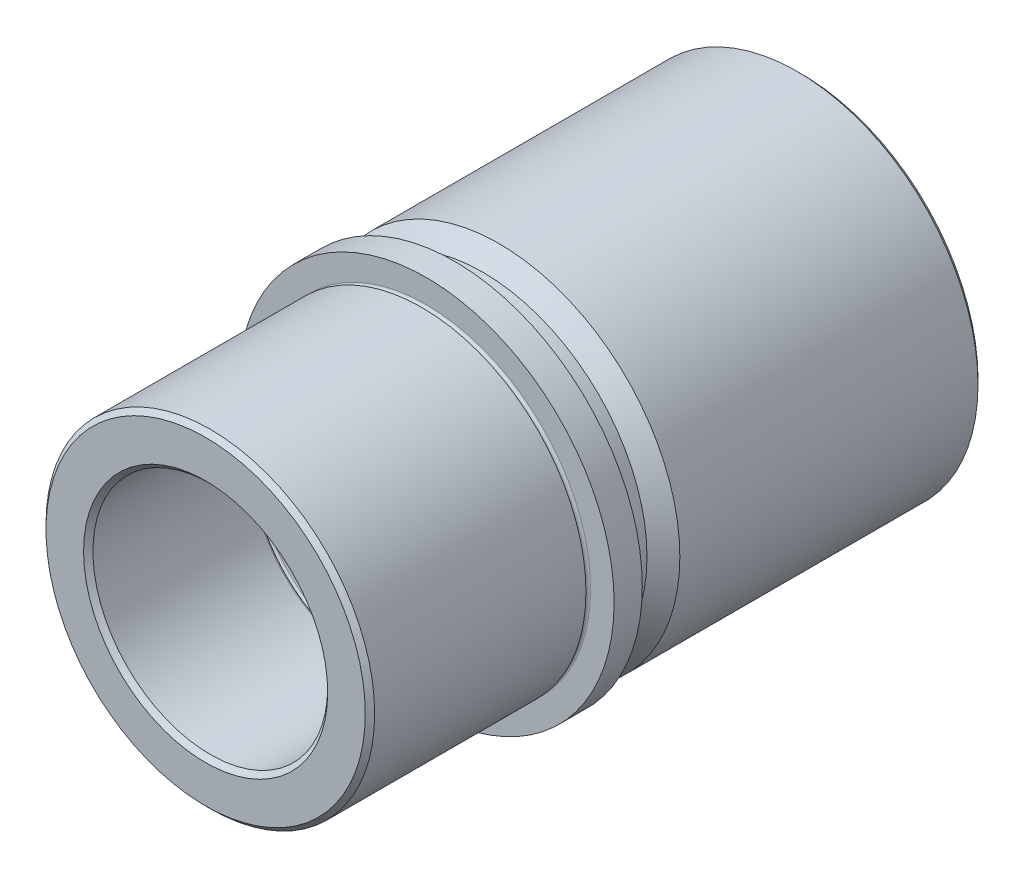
ISO-10303-21;
HEADER;
FILE_DESCRIPTION(('STEP AP214'),'2;1');
FILE_NAME('part.step','',(''),(''),'','','');
FILE_SCHEMA(('AUTOMOTIVE_DESIGN { 1 0 10303 214 1 1 1 1 }'));
ENDSEC;
DATA;
#1=APPLICATION_CONTEXT('core data for automotive mechanical design processes');
#2=APPLICATION_PROTOCOL_DEFINITION('international standard','automotive_design',2000,#1);
#3=PRODUCT_CONTEXT('',#1,'mechanical');
#4=PRODUCT('Part','Part','',(#3));
#5=PRODUCT_RELATED_PRODUCT_CATEGORY('part','',(#4));
#6=PRODUCT_DEFINITION_FORMATION('','',#4);
#7=PRODUCT_DEFINITION_CONTEXT('part definition',#1,'design');
#8=PRODUCT_DEFINITION('design','',#6,#7);
#9=PRODUCT_DEFINITION_SHAPE('','',#8);
#10=(LENGTH_UNIT() NAMED_UNIT(*) SI_UNIT(.MILLI.,.METRE.));
#11=(NAMED_UNIT(*) PLANE_ANGLE_UNIT() SI_UNIT($,.RADIAN.));
#12=(NAMED_UNIT(*) SI_UNIT($,.STERADIAN.) SOLID_ANGLE_UNIT());
#13=UNCERTAINTY_MEASURE_WITH_UNIT(LENGTH_MEASURE(1.E-05),#10,'distance_accuracy_value','');
#14=(GEOMETRIC_REPRESENTATION_CONTEXT(3) GLOBAL_UNCERTAINTY_ASSIGNED_CONTEXT((#13)) GLOBAL_UNIT_ASSIGNED_CONTEXT((#10,
#11,#12)) REPRESENTATION_CONTEXT('',''));
#15=CARTESIAN_POINT('',(0.,0.,0.));
#16=DIRECTION('',(0.,0.,1.));
#17=DIRECTION('',(1.,0.,0.));
#18=AXIS2_PLACEMENT_3D('',#15,#16,#17);
#19=CARTESIAN_POINT('',(0.,0.,-83.5));
#20=DIRECTION('',(0.,0.,1.));
#21=DIRECTION('',(1.,0.,0.));
#22=AXIS2_PLACEMENT_3D('',#19,#20,#21);
#23=TOROIDAL_SURFACE('',#22,25.5,0.5);
#24=CARTESIAN_POINT('',(0.,0.,-83.5));
#25=DIRECTION('',(0.,0.,1.));
#26=DIRECTION('',(1.,0.,0.));
#27=AXIS2_PLACEMENT_3D('',#24,#25,#26);
#28=CIRCLE('',#27,25.);
#29=CARTESIAN_POINT('',(25.,0.,-83.5));
#30=VERTEX_POINT('',#29);
#31=EDGE_CURVE('E81',#30,#30,#28,.T.);
#32=ORIENTED_EDGE('',*,*,#31,.T.);
#33=EDGE_LOOP('',(#32));
#34=FACE_BOUND('',#33,.T.);
#35=CARTESIAN_POINT('',(0.,0.,-84.));
#36=DIRECTION('',(0.,0.,1.));
#37=DIRECTION('',(1.,0.,0.));
#38=AXIS2_PLACEMENT_3D('',#35,#36,#37);
#39=CIRCLE('',#38,25.5);
#40=CARTESIAN_POINT('',(25.5,0.,-84.));
#41=VERTEX_POINT('',#40);
#42=EDGE_CURVE('E45',#41,#41,#39,.T.);
#43=ORIENTED_EDGE('',*,*,#42,.F.);
#44=EDGE_LOOP('',(#43));
#45=FACE_BOUND('',#44,.T.);
#46=ADVANCED_FACE('F13',(#34,#45),#23,.T.);
#47=CARTESIAN_POINT('',(0.,0.,-84.5));
#48=DIRECTION('',(0.,0.,1.));
#49=DIRECTION('',(1.,0.,0.));
#50=AXIS2_PLACEMENT_3D('',#47,#48,#49);
#51=TOROIDAL_SURFACE('',#50,25.5,0.5);
#52=CARTESIAN_POINT('',(0.,0.,-84.5));
#53=DIRECTION('',(0.,0.,1.));
#54=DIRECTION('',(1.,0.,0.));
#55=AXIS2_PLACEMENT_3D('',#52,#53,#54);
#56=CIRCLE('',#55,25.);
#57=CARTESIAN_POINT('',(25.,0.,-84.5));
#58=VERTEX_POINT('',#57);
#59=EDGE_CURVE('E48',#58,#58,#56,.T.);
#60=ORIENTED_EDGE('',*,*,#59,.F.);
#61=EDGE_LOOP('',(#60));
#62=FACE_BOUND('',#61,.T.);
#63=ORIENTED_EDGE('',*,*,#42,.T.);
#64=EDGE_LOOP('',(#63));
#65=FACE_BOUND('',#64,.T.);
#66=ADVANCED_FACE('F113',(#62,#65),#51,.T.);
#67=CARTESIAN_POINT('',(0.,0.,0.));
#68=DIRECTION('',(0.,0.,1.));
#69=DIRECTION('',(1.,0.,0.));
#70=AXIS2_PLACEMENT_3D('',#67,#68,#69);
#71=CYLINDRICAL_SURFACE('',#70,25.);
#72=CARTESIAN_POINT('',(0.,0.,-126.));
#73=DIRECTION('',(0.,0.,1.));
#74=DIRECTION('',(1.,0.,0.));
#75=AXIS2_PLACEMENT_3D('',#72,#73,#74);
#76=CIRCLE('',#75,25.);
#77=CARTESIAN_POINT('',(25.,0.,-126.));
#78=VERTEX_POINT('',#77);
#79=EDGE_CURVE('E36',#78,#78,#76,.F.);
#80=ORIENTED_EDGE('',*,*,#79,.T.);
#81=EDGE_LOOP('',(#80));
#82=FACE_BOUND('',#81,.T.);
#83=ORIENTED_EDGE('',*,*,#59,.T.);
#84=EDGE_LOOP('',(#83));
#85=FACE_BOUND('',#84,.T.);
#86=ADVANCED_FACE('F118',(#82,#85),#71,.F.);
#87=CARTESIAN_POINT('',(0.,0.,-127.));
#88=DIRECTION('',(0.,0.,1.));
#89=DIRECTION('',(1.,0.,0.));
#90=AXIS2_PLACEMENT_3D('',#87,#88,#89);
#91=PLANE('',#90);
#92=CARTESIAN_POINT('',(0.,0.,-127.));
#93=DIRECTION('',(0.,0.,1.));
#94=DIRECTION('',(1.,0.,0.));
#95=AXIS2_PLACEMENT_3D('',#92,#93,#94);
#96=CIRCLE('',#95,26.);
#97=CARTESIAN_POINT('',(26.,0.,-127.));
#98=VERTEX_POINT('',#97);
#99=EDGE_CURVE('E39',#98,#98,#96,.T.);
#100=ORIENTED_EDGE('',*,*,#99,.T.);
#101=EDGE_LOOP('',(#100));
#102=FACE_BOUND('',#101,.T.);
#103=CARTESIAN_POINT('',(0.,0.,-127.));
#104=DIRECTION('',(0.,0.,1.));
#105=DIRECTION('',(1.,0.,0.));
#106=AXIS2_PLACEMENT_3D('',#103,#104,#105);
#107=CIRCLE('',#106,37.5);
#108=CARTESIAN_POINT('',(37.5,0.,-127.));
#109=VERTEX_POINT('',#108);
#110=EDGE_CURVE('E42',#109,#109,#107,.F.);
#111=ORIENTED_EDGE('',*,*,#110,.T.);
#112=EDGE_LOOP('',(#111));
#113=FACE_BOUND('',#112,.T.);
#114=ADVANCED_FACE('F185',(#102,#113),#91,.F.);
#115=CARTESIAN_POINT('',(0.,0.,0.));
#116=DIRECTION('',(0.,0.,1.));
#117=DIRECTION('',(1.,0.,0.));
#118=AXIS2_PLACEMENT_3D('',#115,#116,#117);
#119=CYLINDRICAL_SURFACE('',#118,38.5);
#120=CARTESIAN_POINT('',(0.,0.,-126.));
#121=DIRECTION('',(0.,0.,1.));
#122=DIRECTION('',(1.,0.,0.));
#123=AXIS2_PLACEMENT_3D('',#120,#121,#122);
#124=CIRCLE('',#123,38.5);
#125=CARTESIAN_POINT('',(38.5,0.,-126.));
#126=VERTEX_POINT('',#125);
#127=EDGE_CURVE('E33',#126,#126,#124,.T.);
#128=ORIENTED_EDGE('',*,*,#127,.T.);
#129=EDGE_LOOP('',(#128));
#130=FACE_BOUND('',#129,.T.);
#131=CARTESIAN_POINT('',(0.,0.,-62.5));
#132=DIRECTION('',(0.,0.,1.));
#133=DIRECTION('',(1.,0.,0.));
#134=AXIS2_PLACEMENT_3D('',#131,#132,#133);
#135=CIRCLE('',#134,38.5);
#136=CARTESIAN_POINT('',(38.5,0.,-62.5));
#137=VERTEX_POINT('',#136);
#138=EDGE_CURVE('E51',#137,#137,#135,.T.);
#139=ORIENTED_EDGE('',*,*,#138,.F.);
#140=EDGE_LOOP('',(#139));
#141=FACE_BOUND('',#140,.T.);
#142=ADVANCED_FACE('F181',(#130,#141),#119,.T.);
#143=CARTESIAN_POINT('',(0.,0.,-59.));
#144=DIRECTION('',(0.,0.,-1.));
#145=DIRECTION('',(-1.,0.,0.));
#146=AXIS2_PLACEMENT_3D('',#143,#144,#145);
#147=CONICAL_SURFACE('',#146,35.,0.785398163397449);
#148=ORIENTED_EDGE('',*,*,#138,.T.);
#149=EDGE_LOOP('',(#148));
#150=FACE_BOUND('',#149,.T.);
#151=CARTESIAN_POINT('',(0.,0.,-59.));
#152=DIRECTION('',(0.,0.,1.));
#153=DIRECTION('',(1.,0.,0.));
#154=AXIS2_PLACEMENT_3D('',#151,#152,#153);
#155=CIRCLE('',#154,35.);
#156=CARTESIAN_POINT('',(35.,0.,-59.));
#157=VERTEX_POINT('',#156);
#158=EDGE_CURVE('E54',#157,#157,#155,.T.);
#159=ORIENTED_EDGE('',*,*,#158,.F.);
#160=EDGE_LOOP('',(#159));
#161=FACE_BOUND('',#160,.T.);
#162=ADVANCED_FACE('F177',(#150,#161),#147,.T.);
#163=CARTESIAN_POINT('',(0.,0.,0.));
#164=DIRECTION('',(0.,0.,1.));
#165=DIRECTION('',(1.,0.,0.));
#166=AXIS2_PLACEMENT_3D('',#163,#164,#165);
#167=CYLINDRICAL_SURFACE('',#166,35.);
#168=ORIENTED_EDGE('',*,*,#158,.T.);
#169=EDGE_LOOP('',(#168));
#170=FACE_BOUND('',#169,.T.);
#171=CARTESIAN_POINT('',(0.,0.,-53.));
#172=DIRECTION('',(0.,0.,1.));
#173=DIRECTION('',(1.,0.,0.));
#174=AXIS2_PLACEMENT_3D('',#171,#172,#173);
#175=CIRCLE('',#174,35.);
#176=CARTESIAN_POINT('',(35.,0.,-53.));
#177=VERTEX_POINT('',#176);
#178=EDGE_CURVE('E57',#177,#177,#175,.T.);
#179=ORIENTED_EDGE('',*,*,#178,.F.);
#180=EDGE_LOOP('',(#179));
#181=FACE_BOUND('',#180,.T.);
#182=ADVANCED_FACE('F173',(#170,#181),#167,.T.);
#183=CARTESIAN_POINT('',(0.,0.,-53.));
#184=DIRECTION('',(0.,0.,-1.));
#185=DIRECTION('',(-1.,0.,0.));
#186=AXIS2_PLACEMENT_3D('',#183,#184,#185);
#187=PLANE('',#186);
#188=ORIENTED_EDGE('',*,*,#178,.T.);
#189=EDGE_LOOP('',(#188));
#190=FACE_BOUND('',#189,.T.);
#191=CARTESIAN_POINT('',(0.,0.,-53.));
#192=DIRECTION('',(0.,0.,1.));
#193=DIRECTION('',(1.,0.,0.));
#194=AXIS2_PLACEMENT_3D('',#191,#192,#193);
#195=CIRCLE('',#194,40.);
#196=CARTESIAN_POINT('',(40.,0.,-53.));
#197=VERTEX_POINT('',#196);
#198=EDGE_CURVE('E60',#197,#197,#195,.T.);
#199=ORIENTED_EDGE('',*,*,#198,.F.);
#200=EDGE_LOOP('',(#199));
#201=FACE_BOUND('',#200,.T.);
#202=ADVANCED_FACE('F169',(#190,#201),#187,.T.);
#203=CARTESIAN_POINT('',(0.,0.,0.));
#204=DIRECTION('',(0.,0.,1.));
#205=DIRECTION('',(1.,0.,0.));
#206=AXIS2_PLACEMENT_3D('',#203,#204,#205);
#207=CYLINDRICAL_SURFACE('',#206,40.);
#208=ORIENTED_EDGE('',*,*,#198,.T.);
#209=EDGE_LOOP('',(#208));
#210=FACE_BOUND('',#209,.T.);
#211=CARTESIAN_POINT('',(0.,0.,-47.));
#212=DIRECTION('',(0.,0.,1.));
#213=DIRECTION('',(1.,0.,0.));
#214=AXIS2_PLACEMENT_3D('',#211,#212,#213);
#215=CIRCLE('',#214,40.);
#216=CARTESIAN_POINT('',(40.,0.,-47.));
#217=VERTEX_POINT('',#216);
#218=EDGE_CURVE('E63',#217,#217,#215,.T.);
#219=ORIENTED_EDGE('',*,*,#218,.F.);
#220=EDGE_LOOP('',(#219));
#221=FACE_BOUND('',#220,.T.);
#222=ADVANCED_FACE('F165',(#210,#221),#207,.T.);
#223=CARTESIAN_POINT('',(0.,0.,-47.));
#224=DIRECTION('',(0.,0.,1.));
#225=DIRECTION('',(1.,0.,0.));
#226=AXIS2_PLACEMENT_3D('',#223,#224,#225);
#227=PLANE('',#226);
#228=ORIENTED_EDGE('',*,*,#218,.T.);
#229=EDGE_LOOP('',(#228));
#230=FACE_BOUND('',#229,.T.);
#231=CARTESIAN_POINT('',(0.,0.,-47.));
#232=DIRECTION('',(0.,0.,1.));
#233=DIRECTION('',(1.,0.,0.));
#234=AXIS2_PLACEMENT_3D('',#231,#232,#233);
#235=CIRCLE('',#234,35.);
#236=CARTESIAN_POINT('',(35.,0.,-47.));
#237=VERTEX_POINT('',#236);
#238=EDGE_CURVE('E66',#237,#237,#235,.T.);
#239=ORIENTED_EDGE('',*,*,#238,.F.);
#240=EDGE_LOOP('',(#239));
#241=FACE_BOUND('',#240,.T.);
#242=ADVANCED_FACE('F161',(#230,#241),#227,.T.);
#243=CARTESIAN_POINT('',(0.,0.,-46.5));
#244=DIRECTION('',(0.,0.,1.));
#245=DIRECTION('',(1.,0.,0.));
#246=AXIS2_PLACEMENT_3D('',#243,#244,#245);
#247=TOROIDAL_SURFACE('',#246,35.,0.5);
#248=ORIENTED_EDGE('',*,*,#238,.T.);
#249=EDGE_LOOP('',(#248));
#250=FACE_BOUND('',#249,.T.);
#251=CARTESIAN_POINT('',(0.,0.,-46.));
#252=DIRECTION('',(0.,0.,1.));
#253=DIRECTION('',(1.,0.,0.));
#254=AXIS2_PLACEMENT_3D('',#251,#252,#253);
#255=CIRCLE('',#254,35.);
#256=CARTESIAN_POINT('',(35.,0.,-46.));
#257=VERTEX_POINT('',#256);
#258=EDGE_CURVE('E69',#257,#257,#255,.T.);
#259=ORIENTED_EDGE('',*,*,#258,.F.);
#260=EDGE_LOOP('',(#259));
#261=FACE_BOUND('',#260,.T.);
#262=ADVANCED_FACE('F156',(#250,#261),#247,.F.);
#263=CARTESIAN_POINT('',(0.,0.,0.));
#264=DIRECTION('',(0.,0.,1.));
#265=DIRECTION('',(1.,0.,0.));
#266=AXIS2_PLACEMENT_3D('',#263,#264,#265);
#267=CYLINDRICAL_SURFACE('',#266,35.);
#268=CARTESIAN_POINT('',(0.,0.,-1.));
#269=DIRECTION('',(0.,0.,1.));
#270=DIRECTION('',(1.,0.,0.));
#271=AXIS2_PLACEMENT_3D('',#268,#269,#270);
#272=CIRCLE('',#271,35.);
#273=CARTESIAN_POINT('',(35.,0.,-1.));
#274=VERTEX_POINT('',#273);
#275=EDGE_CURVE('E8',#274,#274,#272,.F.);
#276=ORIENTED_EDGE('',*,*,#275,.T.);
#277=EDGE_LOOP('',(#276));
#278=FACE_BOUND('',#277,.T.);
#279=ORIENTED_EDGE('',*,*,#258,.T.);
#280=EDGE_LOOP('',(#279));
#281=FACE_BOUND('',#280,.T.);
#282=ADVANCED_FACE('F149',(#278,#281),#267,.T.);
#283=CARTESIAN_POINT('',(0.,0.,0.));
#284=DIRECTION('',(0.,0.,1.));
#285=DIRECTION('',(1.,0.,0.));
#286=AXIS2_PLACEMENT_3D('',#283,#284,#285);
#287=PLANE('',#286);
#288=CARTESIAN_POINT('',(0.,0.,0.));
#289=DIRECTION('',(0.,0.,1.));
#290=DIRECTION('',(1.,0.,0.));
#291=AXIS2_PLACEMENT_3D('',#288,#289,#290);
#292=CIRCLE('',#291,26.);
#293=CARTESIAN_POINT('',(26.,0.,0.));
#294=VERTEX_POINT('',#293);
#295=EDGE_CURVE('E20',#294,#294,#292,.F.);
#296=ORIENTED_EDGE('',*,*,#295,.T.);
#297=EDGE_LOOP('',(#296));
#298=FACE_BOUND('',#297,.T.);
#299=CARTESIAN_POINT('',(0.,0.,0.));
#300=DIRECTION('',(0.,0.,1.));
#301=DIRECTION('',(1.,0.,0.));
#302=AXIS2_PLACEMENT_3D('',#299,#300,#301);
#303=CIRCLE('',#302,34.);
#304=CARTESIAN_POINT('',(34.,0.,0.));
#305=VERTEX_POINT('',#304);
#306=EDGE_CURVE('E24',#305,#305,#303,.T.);
#307=ORIENTED_EDGE('',*,*,#306,.T.);
#308=EDGE_LOOP('',(#307));
#309=FACE_BOUND('',#308,.T.);
#310=ADVANCED_FACE('F109',(#298,#309),#287,.T.);
#311=CARTESIAN_POINT('',(0.,0.,0.));
#312=DIRECTION('',(0.,0.,1.));
#313=DIRECTION('',(1.,0.,0.));
#314=AXIS2_PLACEMENT_3D('',#311,#312,#313);
#315=CYLINDRICAL_SURFACE('',#314,25.);
#316=CARTESIAN_POINT('',(0.,0.,-1.));
#317=DIRECTION('',(0.,0.,1.));
#318=DIRECTION('',(1.,0.,0.));
#319=AXIS2_PLACEMENT_3D('',#316,#317,#318);
#320=CIRCLE('',#319,25.);
#321=CARTESIAN_POINT('',(25.,0.,-1.));
#322=VERTEX_POINT('',#321);
#323=EDGE_CURVE('E28',#322,#322,#320,.T.);
#324=ORIENTED_EDGE('',*,*,#323,.T.);
#325=EDGE_LOOP('',(#324));
#326=FACE_BOUND('',#325,.T.);
#327=CARTESIAN_POINT('',(0.,0.,-34.5));
#328=DIRECTION('',(0.,0.,1.));
#329=DIRECTION('',(1.,0.,0.));
#330=AXIS2_PLACEMENT_3D('',#327,#328,#329);
#331=CIRCLE('',#330,25.);
#332=CARTESIAN_POINT('',(25.,0.,-34.5));
#333=VERTEX_POINT('',#332);
#334=EDGE_CURVE('E72',#333,#333,#331,.T.);
#335=ORIENTED_EDGE('',*,*,#334,.F.);
#336=EDGE_LOOP('',(#335));
#337=FACE_BOUND('',#336,.T.);
#338=ADVANCED_FACE('F102',(#326,#337),#315,.F.);
#339=CARTESIAN_POINT('',(0.,0.,-34.5));
#340=DIRECTION('',(0.,0.,1.));
#341=DIRECTION('',(1.,0.,0.));
#342=AXIS2_PLACEMENT_3D('',#339,#340,#341);
#343=TOROIDAL_SURFACE('',#342,25.5,0.5);
#344=ORIENTED_EDGE('',*,*,#334,.T.);
#345=EDGE_LOOP('',(#344));
#346=FACE_BOUND('',#345,.T.);
#347=CARTESIAN_POINT('',(0.,0.,-35.));
#348=DIRECTION('',(0.,0.,1.));
#349=DIRECTION('',(1.,0.,0.));
#350=AXIS2_PLACEMENT_3D('',#347,#348,#349);
#351=CIRCLE('',#350,25.5);
#352=CARTESIAN_POINT('',(25.5,0.,-35.));
#353=VERTEX_POINT('',#352);
#354=EDGE_CURVE('E75',#353,#353,#351,.T.);
#355=ORIENTED_EDGE('',*,*,#354,.F.);
#356=EDGE_LOOP('',(#355));
#357=FACE_BOUND('',#356,.T.);
#358=ADVANCED_FACE('F97',(#346,#357),#343,.T.);
#359=CARTESIAN_POINT('',(0.,0.,-35.5));
#360=DIRECTION('',(0.,0.,1.));
#361=DIRECTION('',(1.,0.,0.));
#362=AXIS2_PLACEMENT_3D('',#359,#360,#361);
#363=TOROIDAL_SURFACE('',#362,25.5,0.5);
#364=CARTESIAN_POINT('',(0.,0.,-35.5));
#365=DIRECTION('',(0.,0.,1.));
#366=DIRECTION('',(1.,0.,0.));
#367=AXIS2_PLACEMENT_3D('',#364,#365,#366);
#368=CIRCLE('',#367,25.);
#369=CARTESIAN_POINT('',(25.,0.,-35.5));
#370=VERTEX_POINT('',#369);
#371=EDGE_CURVE('E78',#370,#370,#368,.T.);
#372=ORIENTED_EDGE('',*,*,#371,.F.);
#373=EDGE_LOOP('',(#372));
#374=FACE_BOUND('',#373,.T.);
#375=ORIENTED_EDGE('',*,*,#354,.T.);
#376=EDGE_LOOP('',(#375));
#377=FACE_BOUND('',#376,.T.);
#378=ADVANCED_FACE('F91',(#374,#377),#363,.T.);
#379=CARTESIAN_POINT('',(0.,0.,0.));
#380=DIRECTION('',(0.,0.,1.));
#381=DIRECTION('',(1.,0.,0.));
#382=AXIS2_PLACEMENT_3D('',#379,#380,#381);
#383=CYLINDRICAL_SURFACE('',#382,25.);
#384=ORIENTED_EDGE('',*,*,#31,.F.);
#385=EDGE_LOOP('',(#384));
#386=FACE_BOUND('',#385,.T.);
#387=ORIENTED_EDGE('',*,*,#371,.T.);
#388=EDGE_LOOP('',(#387));
#389=FACE_BOUND('',#388,.T.);
#390=ADVANCED_FACE('F87',(#386,#389),#383,.F.);
#391=CARTESIAN_POINT('',(0.,0.,-127.));
#392=DIRECTION('',(0.,0.,-1.));
#393=DIRECTION('',(-1.,0.,0.));
#394=AXIS2_PLACEMENT_3D('',#391,#392,#393);
#395=CONICAL_SURFACE('',#394,26.,0.785398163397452);
#396=ORIENTED_EDGE('',*,*,#79,.F.);
#397=EDGE_LOOP('',(#396));
#398=FACE_BOUND('',#397,.T.);
#399=ORIENTED_EDGE('',*,*,#99,.F.);
#400=EDGE_LOOP('',(#399));
#401=FACE_BOUND('',#400,.T.);
#402=ADVANCED_FACE('F90',(#398,#401),#395,.F.);
#403=CARTESIAN_POINT('',(0.,0.,-126.));
#404=DIRECTION('',(0.,0.,1.));
#405=DIRECTION('',(1.,0.,0.));
#406=AXIS2_PLACEMENT_3D('',#403,#404,#405);
#407=CONICAL_SURFACE('',#406,38.5,0.785398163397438);
#408=ORIENTED_EDGE('',*,*,#110,.F.);
#409=EDGE_LOOP('',(#408));
#410=FACE_BOUND('',#409,.T.);
#411=ORIENTED_EDGE('',*,*,#127,.F.);
#412=EDGE_LOOP('',(#411));
#413=FACE_BOUND('',#412,.T.);
#414=ADVANCED_FACE('F125',(#410,#413),#407,.T.);
#415=CARTESIAN_POINT('',(0.,0.,-1.));
#416=DIRECTION('',(0.,0.,1.));
#417=DIRECTION('',(1.,0.,0.));
#418=AXIS2_PLACEMENT_3D('',#415,#416,#417);
#419=CONICAL_SURFACE('',#418,25.,0.785398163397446);
#420=ORIENTED_EDGE('',*,*,#295,.F.);
#421=EDGE_LOOP('',(#420));
#422=FACE_BOUND('',#421,.T.);
#423=ORIENTED_EDGE('',*,*,#323,.F.);
#424=EDGE_LOOP('',(#423));
#425=FACE_BOUND('',#424,.T.);
#426=ADVANCED_FACE('F128',(#422,#425),#419,.F.);
#427=CARTESIAN_POINT('',(0.,0.,0.));
#428=DIRECTION('',(0.,0.,-1.));
#429=DIRECTION('',(-1.,0.,0.));
#430=AXIS2_PLACEMENT_3D('',#427,#428,#429);
#431=CONICAL_SURFACE('',#430,34.,0.785398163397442);
#432=ORIENTED_EDGE('',*,*,#275,.F.);
#433=EDGE_LOOP('',(#432));
#434=FACE_BOUND('',#433,.T.);
#435=ORIENTED_EDGE('',*,*,#306,.F.);
#436=EDGE_LOOP('',(#435));
#437=FACE_BOUND('',#436,.T.);
#438=ADVANCED_FACE('F15',(#434,#437),#431,.T.);
#439=CLOSED_SHELL('',(#46,#66,#86,#114,#142,#162,#182,#202,#222,#242,#262,#282,#310,#338,#358,
#378,#390,#402,#414,#426,#438));
#440=MANIFOLD_SOLID_BREP('B1',#439);
#441=ADVANCED_BREP_SHAPE_REPRESENTATION('',(#18,#440),#14);
#442=SHAPE_DEFINITION_REPRESENTATION(#9,#441);
ENDSEC;
END-ISO-10303-21;
